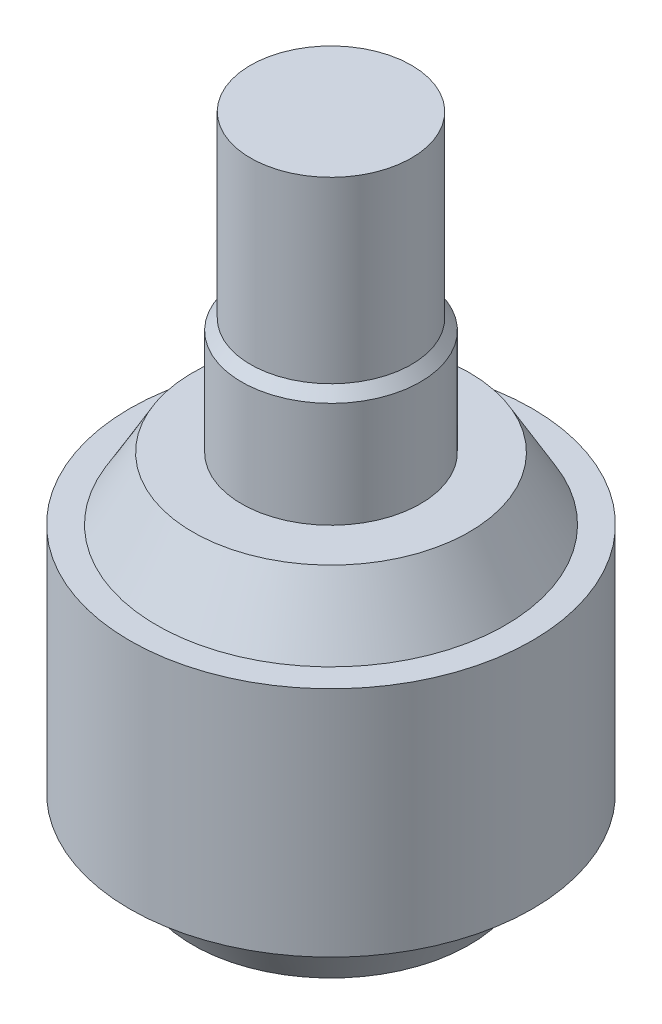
ISO-10303-21;
HEADER;
FILE_DESCRIPTION(('STEP AP214'),'2;1');
FILE_NAME('part.step','',(''),(''),'','','');
FILE_SCHEMA(('AUTOMOTIVE_DESIGN { 1 0 10303 214 1 1 1 1 }'));
ENDSEC;
DATA;
#1=APPLICATION_CONTEXT('core data for automotive mechanical design processes');
#2=APPLICATION_PROTOCOL_DEFINITION('international standard','automotive_design',2000,#1);
#3=PRODUCT_CONTEXT('',#1,'mechanical');
#4=PRODUCT('Part','Part','',(#3));
#5=PRODUCT_RELATED_PRODUCT_CATEGORY('part','',(#4));
#6=PRODUCT_DEFINITION_FORMATION('','',#4);
#7=PRODUCT_DEFINITION_CONTEXT('part definition',#1,'design');
#8=PRODUCT_DEFINITION('design','',#6,#7);
#9=PRODUCT_DEFINITION_SHAPE('','',#8);
#10=(LENGTH_UNIT() NAMED_UNIT(*) SI_UNIT(.MILLI.,.METRE.));
#11=(NAMED_UNIT(*) PLANE_ANGLE_UNIT() SI_UNIT($,.RADIAN.));
#12=(NAMED_UNIT(*) SI_UNIT($,.STERADIAN.) SOLID_ANGLE_UNIT());
#13=UNCERTAINTY_MEASURE_WITH_UNIT(LENGTH_MEASURE(1.E-05),#10,'distance_accuracy_value','');
#14=(GEOMETRIC_REPRESENTATION_CONTEXT(3) GLOBAL_UNCERTAINTY_ASSIGNED_CONTEXT((#13)) GLOBAL_UNIT_ASSIGNED_CONTEXT((#10,
#11,#12)) REPRESENTATION_CONTEXT('',''));
#15=CARTESIAN_POINT('',(0.,0.,0.));
#16=DIRECTION('',(0.,0.,1.));
#17=DIRECTION('',(1.,0.,0.));
#18=AXIS2_PLACEMENT_3D('',#15,#16,#17);
#19=CARTESIAN_POINT('',(0.,0.,0.));
#20=DIRECTION('',(0.,1.,0.));
#21=DIRECTION('',(0.,0.,1.00000000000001));
#22=AXIS2_PLACEMENT_3D('',#19,#20,#21);
#23=CONICAL_SURFACE('',#22,1.54585481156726,0.523598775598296);
#24=CARTESIAN_POINT('',(0.,0.700000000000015,0.));
#25=DIRECTION('',(0.,-1.,0.));
#26=DIRECTION('',(0.,0.,-1.00000000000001));
#27=AXIS2_PLACEMENT_3D('',#24,#25,#26);
#28=CIRCLE('',#27,1.95);
#29=CARTESIAN_POINT('',(0.,0.700000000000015,-1.95));
#30=VERTEX_POINT('',#29);
#31=EDGE_CURVE('E10',#30,#30,#28,.T.);
#32=ORIENTED_EDGE('',*,*,#31,.T.);
#33=EDGE_LOOP('',(#32));
#34=FACE_BOUND('',#33,.T.);
#35=CARTESIAN_POINT('',(0.,0.,0.));
#36=DIRECTION('',(0.,-1.,0.));
#37=DIRECTION('',(0.,0.,-1.00000000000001));
#38=AXIS2_PLACEMENT_3D('',#35,#36,#37);
#39=CIRCLE('',#38,1.54585481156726);
#40=CARTESIAN_POINT('',(0.,0.,-1.54585481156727));
#41=VERTEX_POINT('',#40);
#42=EDGE_CURVE('E64',#41,#41,#39,.T.);
#43=ORIENTED_EDGE('',*,*,#42,.F.);
#44=EDGE_LOOP('',(#43));
#45=FACE_BOUND('',#44,.T.);
#46=ADVANCED_FACE('F30',(#34,#45),#23,.T.);
#47=CARTESIAN_POINT('',(1.94999999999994,0.70000000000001,0.));
#48=DIRECTION('',(0.,-1.,0.));
#49=DIRECTION('',(0.,0.,-1.00000000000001));
#50=AXIS2_PLACEMENT_3D('',#47,#48,#49);
#51=PLANE('',#50);
#52=CARTESIAN_POINT('',(0.,0.700000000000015,0.));
#53=DIRECTION('',(0.,-1.,0.));
#54=DIRECTION('',(0.,0.,-1.00000000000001));
#55=AXIS2_PLACEMENT_3D('',#52,#53,#54);
#56=CIRCLE('',#55,2.25);
#57=CARTESIAN_POINT('',(0.,0.700000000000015,-2.25));
#58=VERTEX_POINT('',#57);
#59=EDGE_CURVE('E36',#58,#58,#56,.T.);
#60=ORIENTED_EDGE('',*,*,#59,.T.);
#61=EDGE_LOOP('',(#60));
#62=FACE_BOUND('',#61,.T.);
#63=ORIENTED_EDGE('',*,*,#31,.F.);
#64=EDGE_LOOP('',(#63));
#65=FACE_BOUND('',#64,.T.);
#66=ADVANCED_FACE('F71',(#62,#65),#51,.T.);
#67=CARTESIAN_POINT('',(0.,0.,0.));
#68=DIRECTION('',(0.,-1.,0.));
#69=DIRECTION('',(0.,0.,-1.00000000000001));
#70=AXIS2_PLACEMENT_3D('',#67,#68,#69);
#71=CYLINDRICAL_SURFACE('',#70,2.25);
#72=CARTESIAN_POINT('',(0.,3.3,-1.00613961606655E-13));
#73=DIRECTION('',(0.,-1.,0.));
#74=DIRECTION('',(0.,0.,-1.00000000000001));
#75=AXIS2_PLACEMENT_3D('',#72,#73,#74);
#76=CIRCLE('',#75,2.25);
#77=CARTESIAN_POINT('',(0.,3.3,-2.25000000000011));
#78=VERTEX_POINT('',#77);
#79=EDGE_CURVE('E40',#78,#78,#76,.T.);
#80=ORIENTED_EDGE('',*,*,#79,.T.);
#81=EDGE_LOOP('',(#80));
#82=FACE_BOUND('',#81,.T.);
#83=ORIENTED_EDGE('',*,*,#59,.F.);
#84=EDGE_LOOP('',(#83));
#85=FACE_BOUND('',#84,.T.);
#86=ADVANCED_FACE('F75',(#82,#85),#71,.T.);
#87=CARTESIAN_POINT('',(2.25,3.30000000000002,0.));
#88=DIRECTION('',(0.,1.,0.));
#89=DIRECTION('',(0.,0.,1.00000000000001));
#90=AXIS2_PLACEMENT_3D('',#87,#88,#89);
#91=PLANE('',#90);
#92=CARTESIAN_POINT('',(0.,3.3,-1.00613961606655E-13));
#93=DIRECTION('',(0.,-1.,0.));
#94=DIRECTION('',(0.,0.,-1.00000000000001));
#95=AXIS2_PLACEMENT_3D('',#92,#93,#94);
#96=CIRCLE('',#95,1.95);
#97=CARTESIAN_POINT('',(0.,3.3,-1.95000000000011));
#98=VERTEX_POINT('',#97);
#99=EDGE_CURVE('E44',#98,#98,#96,.T.);
#100=ORIENTED_EDGE('',*,*,#99,.T.);
#101=EDGE_LOOP('',(#100));
#102=FACE_BOUND('',#101,.T.);
#103=ORIENTED_EDGE('',*,*,#79,.F.);
#104=EDGE_LOOP('',(#103));
#105=FACE_BOUND('',#104,.T.);
#106=ADVANCED_FACE('F79',(#102,#105),#91,.T.);
#107=CARTESIAN_POINT('',(0.,3.3,-1.00613961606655E-13));
#108=DIRECTION('',(0.,-1.,0.));
#109=DIRECTION('',(0.,0.,-1.00000000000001));
#110=AXIS2_PLACEMENT_3D('',#107,#108,#109);
#111=CONICAL_SURFACE('',#110,1.95,0.523598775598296);
#112=CARTESIAN_POINT('',(0.,4.,-1.07552855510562E-13));
#113=DIRECTION('',(0.,-1.,0.));
#114=DIRECTION('',(0.,0.,-1.00000000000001));
#115=AXIS2_PLACEMENT_3D('',#112,#113,#114);
#116=CIRCLE('',#115,1.54585481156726);
#117=CARTESIAN_POINT('',(0.,4.,-1.54585481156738));
#118=VERTEX_POINT('',#117);
#119=EDGE_CURVE('E49',#118,#118,#116,.T.);
#120=ORIENTED_EDGE('',*,*,#119,.T.);
#121=EDGE_LOOP('',(#120));
#122=FACE_BOUND('',#121,.T.);
#123=ORIENTED_EDGE('',*,*,#99,.F.);
#124=EDGE_LOOP('',(#123));
#125=FACE_BOUND('',#124,.T.);
#126=ADVANCED_FACE('F86',(#122,#125),#111,.T.);
#127=CARTESIAN_POINT('',(1.54585481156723,3.99999999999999,-1.00613961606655E-13));
#128=DIRECTION('',(0.,1.,0.));
#129=DIRECTION('',(0.,0.,1.00000000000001));
#130=AXIS2_PLACEMENT_3D('',#127,#128,#129);
#131=PLANE('',#130);
#132=CARTESIAN_POINT('',(0.,4.,-1.07552855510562E-13));
#133=DIRECTION('',(0.,-1.,0.));
#134=DIRECTION('',(0.,0.,-1.00000000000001));
#135=AXIS2_PLACEMENT_3D('',#132,#133,#134);
#136=CIRCLE('',#135,1.);
#137=CARTESIAN_POINT('',(0.,4.,-1.00000000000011));
#138=VERTEX_POINT('',#137);
#139=EDGE_CURVE('E52',#138,#138,#136,.T.);
#140=ORIENTED_EDGE('',*,*,#139,.T.);
#141=EDGE_LOOP('',(#140));
#142=FACE_BOUND('',#141,.T.);
#143=ORIENTED_EDGE('',*,*,#119,.F.);
#144=EDGE_LOOP('',(#143));
#145=FACE_BOUND('',#144,.T.);
#146=ADVANCED_FACE('F90',(#142,#145),#131,.T.);
#147=CARTESIAN_POINT('',(0.,0.,0.));
#148=DIRECTION('',(0.,-1.,0.));
#149=DIRECTION('',(0.,0.,-1.00000000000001));
#150=AXIS2_PLACEMENT_3D('',#147,#148,#149);
#151=CYLINDRICAL_SURFACE('',#150,1.);
#152=CARTESIAN_POINT('',(0.,5.18082464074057,0.));
#153=DIRECTION('',(0.,-1.,0.));
#154=DIRECTION('',(0.,0.,-1.00000000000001));
#155=AXIS2_PLACEMENT_3D('',#152,#153,#154);
#156=CIRCLE('',#155,1.);
#157=CARTESIAN_POINT('',(0.,5.18082464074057,-1.00000000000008));
#158=VERTEX_POINT('',#157);
#159=EDGE_CURVE('E55',#158,#158,#156,.T.);
#160=ORIENTED_EDGE('',*,*,#159,.T.);
#161=EDGE_LOOP('',(#160));
#162=FACE_BOUND('',#161,.T.);
#163=ORIENTED_EDGE('',*,*,#139,.F.);
#164=EDGE_LOOP('',(#163));
#165=FACE_BOUND('',#164,.T.);
#166=ADVANCED_FACE('F94',(#162,#165),#151,.T.);
#167=CARTESIAN_POINT('',(0.,5.18082464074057,0.));
#168=DIRECTION('',(0.,-1.,0.));
#169=DIRECTION('',(0.,0.,-1.00000000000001));
#170=AXIS2_PLACEMENT_3D('',#167,#168,#169);
#171=CONICAL_SURFACE('',#170,1.,0.698131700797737);
#172=CARTESIAN_POINT('',(0.,5.3,-1.04083408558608E-13));
#173=DIRECTION('',(0.,-1.,0.));
#174=DIRECTION('',(0.,0.,-1.00000000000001));
#175=AXIS2_PLACEMENT_3D('',#172,#173,#174);
#176=CIRCLE('',#175,0.9);
#177=CARTESIAN_POINT('',(0.,5.3,-0.900000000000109));
#178=VERTEX_POINT('',#177);
#179=EDGE_CURVE('E58',#178,#178,#176,.T.);
#180=ORIENTED_EDGE('',*,*,#179,.T.);
#181=EDGE_LOOP('',(#180));
#182=FACE_BOUND('',#181,.T.);
#183=ORIENTED_EDGE('',*,*,#159,.F.);
#184=EDGE_LOOP('',(#183));
#185=FACE_BOUND('',#184,.T.);
#186=ADVANCED_FACE('F98',(#182,#185),#171,.T.);
#187=CARTESIAN_POINT('',(0.,0.,0.));
#188=DIRECTION('',(0.,-1.,0.));
#189=DIRECTION('',(0.,0.,-1.00000000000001));
#190=AXIS2_PLACEMENT_3D('',#187,#188,#189);
#191=CYLINDRICAL_SURFACE('',#190,0.9);
#192=CARTESIAN_POINT('',(0.,7.3,0.));
#193=DIRECTION('',(0.,-1.,0.));
#194=DIRECTION('',(0.,0.,-1.00000000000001));
#195=AXIS2_PLACEMENT_3D('',#192,#193,#194);
#196=CIRCLE('',#195,0.9);
#197=CARTESIAN_POINT('',(0.,7.3,-0.900000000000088));
#198=VERTEX_POINT('',#197);
#199=EDGE_CURVE('E61',#198,#198,#196,.T.);
#200=ORIENTED_EDGE('',*,*,#199,.T.);
#201=EDGE_LOOP('',(#200));
#202=FACE_BOUND('',#201,.T.);
#203=ORIENTED_EDGE('',*,*,#179,.F.);
#204=EDGE_LOOP('',(#203));
#205=FACE_BOUND('',#204,.T.);
#206=ADVANCED_FACE('F102',(#202,#205),#191,.T.);
#207=CARTESIAN_POINT('',(0.899999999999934,7.30000000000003,0.));
#208=DIRECTION('',(0.,1.,0.));
#209=DIRECTION('',(0.,0.,1.00000000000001));
#210=AXIS2_PLACEMENT_3D('',#207,#208,#209);
#211=PLANE('',#210);
#212=ORIENTED_EDGE('',*,*,#199,.F.);
#213=EDGE_LOOP('',(#212));
#214=FACE_BOUND('',#213,.T.);
#215=ADVANCED_FACE('F106',(#214),#211,.T.);
#216=CARTESIAN_POINT('',(0.,0.,0.));
#217=DIRECTION('',(0.,-1.,0.));
#218=DIRECTION('',(0.,0.,-1.00000000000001));
#219=AXIS2_PLACEMENT_3D('',#216,#217,#218);
#220=PLANE('',#219);
#221=ORIENTED_EDGE('',*,*,#42,.T.);
#222=EDGE_LOOP('',(#221));
#223=FACE_BOUND('',#222,.T.);
#224=ADVANCED_FACE('F68',(#223),#220,.T.);
#225=CLOSED_SHELL('',(#46,#66,#86,#106,#126,#146,#166,#186,#206,#215,#224));
#226=MANIFOLD_SOLID_BREP('B2',#225);
#227=ADVANCED_BREP_SHAPE_REPRESENTATION('',(#18,#226),#14);
#228=SHAPE_DEFINITION_REPRESENTATION(#9,#227);
ENDSEC;
END-ISO-10303-21;
